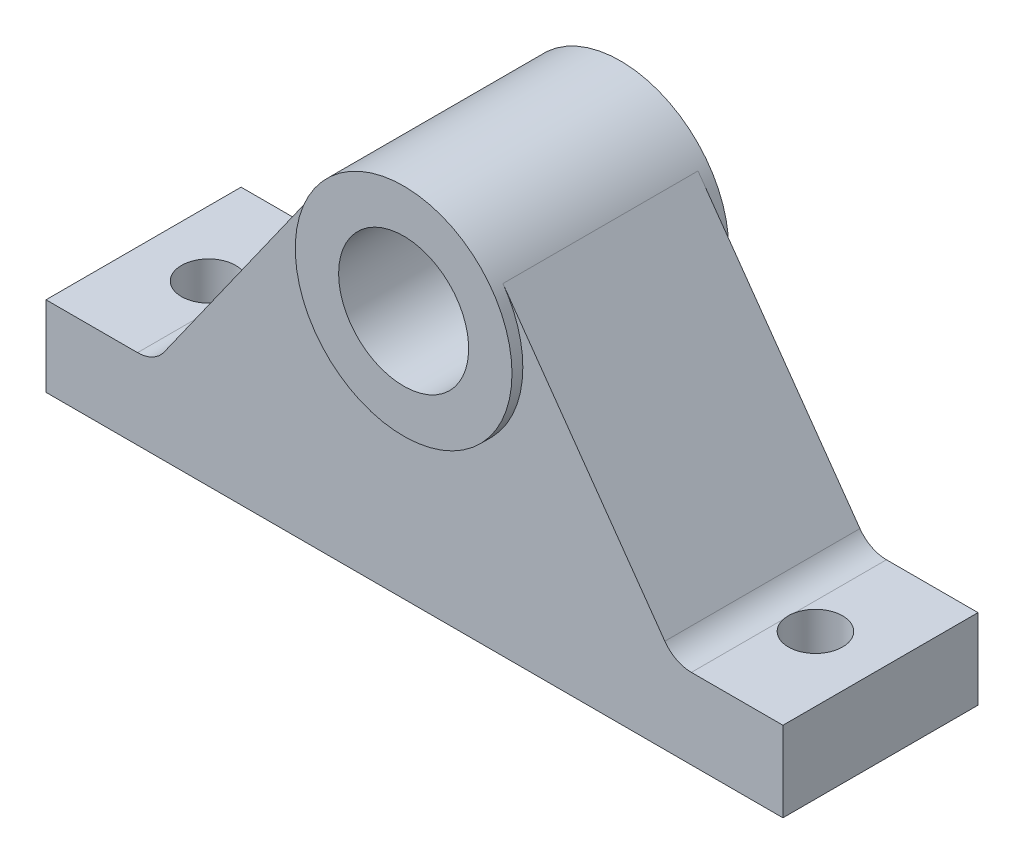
from build123d import *

# Parameters (mm, degrees)
SKETCH_1_R          = 30
EXTRUDE_1_DEPTH     = 45
SKETCH_3_R          = 50
SKETCH_3_R_2        = 30
EXTRUDE_2_DEPTH     = 5
FILLET_1_R          = 15
SKETCH_4_R          = 12.5
CUT_EXTRUDE_1_DEPTH = 246.560583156


with BuildPart() as part:
    # Sketch 1 → Extrude 1 (new, symmetric)
    with BuildSketch(Plane.XY):
        with BuildLine():
            Line((-170, 0), (-120, 0))
            Line((-120, 0), (-40.812289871, 111.885238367))
            ThreePointArc((-40.812289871, 111.885238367), (0, 133), (40.812289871, 111.885238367))
            Line((40.812289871, 111.885238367), (120, 0))
            Line((120, 0), (170, 0))
            Line((170, 0), (170, -37))
            Line((170, -37), (-170, -37))
            Line((-170, -37), (-170, 0))
        make_face()
        with Locations(Location((0, 83, 0), (0, 0, 180))):
            Circle(SKETCH_1_R, mode=Mode.SUBTRACT)
    extrude(amount=EXTRUDE_1_DEPTH, both=True)

    # Sketch 3 → Extrude 2 (add)
    with BuildSketch(Plane.XY.offset(45)):
        with Locations(Location((0, 83, 0), (0, 0, 144.7107304))):
            Circle(SKETCH_3_R)
        with Locations(Location((0, 83, 0), (0, 0, 180))):
            Circle(SKETCH_3_R_2, mode=Mode.SUBTRACT)
    extrude_2 = extrude(amount=EXTRUDE_2_DEPTH)

    # Mirror 1: Extrude 2 across plane
    add(extrude_2.mirror(Plane.XY))

    # Fillet 1
    fillet_1_edges = [part.edges().sort_by_distance(p)[0] for p in [
        (120, 0, 0),
        (-120, 0, 0),
    ]]
    fillet(fillet_1_edges, radius=FILLET_1_R)

    # Sketch 4 → Cut-Extrude 1 (cut, through all)
    with BuildSketch(Plane.XZ.offset(37)):
        with Locations((-140, 0)):
            Circle(SKETCH_4_R)
        with Locations((140, 0)):
            Circle(SKETCH_4_R)
    extrude(amount=-CUT_EXTRUDE_1_DEPTH, mode=Mode.SUBTRACT)


solid = part.part
